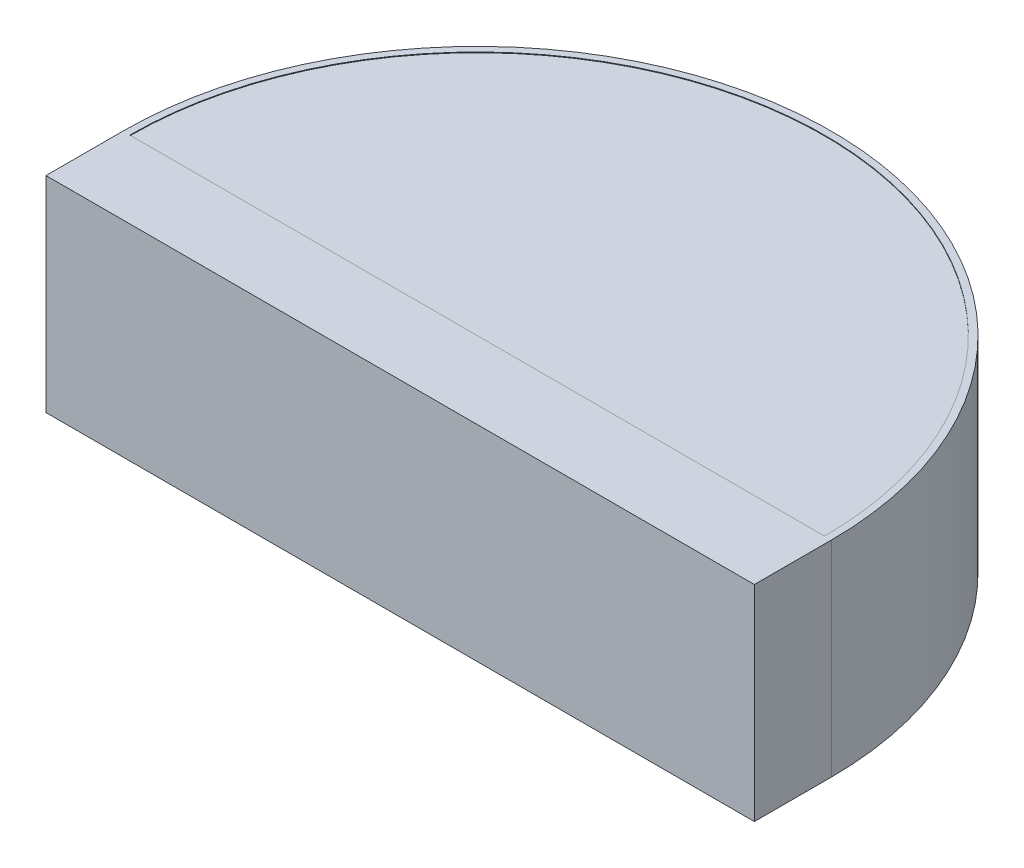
ISO-10303-21;
HEADER;
FILE_DESCRIPTION(('STEP AP214'),'2;1');
FILE_NAME('part.step','',(''),(''),'','','');
FILE_SCHEMA(('AUTOMOTIVE_DESIGN { 1 0 10303 214 1 1 1 1 }'));
ENDSEC;
DATA;
#1=APPLICATION_CONTEXT('core data for automotive mechanical design processes');
#2=APPLICATION_PROTOCOL_DEFINITION('international standard','automotive_design',2000,#1);
#3=PRODUCT_CONTEXT('',#1,'mechanical');
#4=PRODUCT('Part','Part','',(#3));
#5=PRODUCT_RELATED_PRODUCT_CATEGORY('part','',(#4));
#6=PRODUCT_DEFINITION_FORMATION('','',#4);
#7=PRODUCT_DEFINITION_CONTEXT('part definition',#1,'design');
#8=PRODUCT_DEFINITION('design','',#6,#7);
#9=PRODUCT_DEFINITION_SHAPE('','',#8);
#10=(LENGTH_UNIT() NAMED_UNIT(*) SI_UNIT(.MILLI.,.METRE.));
#11=(NAMED_UNIT(*) PLANE_ANGLE_UNIT() SI_UNIT($,.RADIAN.));
#12=(NAMED_UNIT(*) SI_UNIT($,.STERADIAN.) SOLID_ANGLE_UNIT());
#13=UNCERTAINTY_MEASURE_WITH_UNIT(LENGTH_MEASURE(1.E-05),#10,'distance_accuracy_value','');
#14=(GEOMETRIC_REPRESENTATION_CONTEXT(3) GLOBAL_UNCERTAINTY_ASSIGNED_CONTEXT((#13)) GLOBAL_UNIT_ASSIGNED_CONTEXT((#10,
#11,#12)) REPRESENTATION_CONTEXT('',''));
#15=CARTESIAN_POINT('',(0.,0.,0.));
#16=DIRECTION('',(0.,0.,1.));
#17=DIRECTION('',(1.,0.,0.));
#18=AXIS2_PLACEMENT_3D('',#15,#16,#17);
#19=CARTESIAN_POINT('',(-103.5,60.,0.));
#20=DIRECTION('',(1.,0.,0.));
#21=DIRECTION('',(0.,0.,-1.));
#22=AXIS2_PLACEMENT_3D('',#19,#20,#21);
#23=PLANE('',#22);
#24=DIRECTION('',(0.,0.,1.));
#25=VECTOR('',#24,1.);
#26=CARTESIAN_POINT('',(-103.5,0.,0.));
#27=LINE('',#26,#25);
#28=CARTESIAN_POINT('',(-103.5,0.,-22.5));
#29=VERTEX_POINT('',#28);
#30=CARTESIAN_POINT('',(-103.5,0.,0.));
#31=VERTEX_POINT('',#30);
#32=EDGE_CURVE('E150',#29,#31,#27,.T.);
#33=ORIENTED_EDGE('',*,*,#32,.T.);
#34=DIRECTION('',(0.,-1.,0.));
#35=VECTOR('',#34,1.);
#36=CARTESIAN_POINT('',(-103.5,60.,0.));
#37=LINE('',#36,#35);
#38=CARTESIAN_POINT('',(-103.5,60.,0.));
#39=VERTEX_POINT('',#38);
#40=EDGE_CURVE('E11',#39,#31,#37,.T.);
#41=ORIENTED_EDGE('',*,*,#40,.F.);
#42=DIRECTION('',(0.,0.,1.));
#43=VECTOR('',#42,1.);
#44=CARTESIAN_POINT('',(-103.5,60.,0.));
#45=LINE('',#44,#43);
#46=CARTESIAN_POINT('',(-103.5,60.,-22.5));
#47=VERTEX_POINT('',#46);
#48=EDGE_CURVE('E153',#47,#39,#45,.T.);
#49=ORIENTED_EDGE('',*,*,#48,.F.);
#50=DIRECTION('',(0.,-1.,0.));
#51=VECTOR('',#50,1.);
#52=CARTESIAN_POINT('',(-103.5,60.,-22.5));
#53=LINE('',#52,#51);
#54=EDGE_CURVE('E167',#47,#29,#53,.T.);
#55=ORIENTED_EDGE('',*,*,#54,.T.);
#56=EDGE_LOOP('',(#33,#41,#49,#55));
#57=FACE_BOUND('',#56,.T.);
#58=ADVANCED_FACE('F41',(#57),#23,.F.);
#59=CARTESIAN_POINT('',(103.5,60.,0.));
#60=DIRECTION('',(0.,0.,-1.));
#61=DIRECTION('',(-1.,0.,0.));
#62=AXIS2_PLACEMENT_3D('',#59,#60,#61);
#63=PLANE('',#62);
#64=DIRECTION('',(1.,0.,0.));
#65=VECTOR('',#64,1.);
#66=CARTESIAN_POINT('',(103.5,0.,0.));
#67=LINE('',#66,#65);
#68=CARTESIAN_POINT('',(103.5,0.,0.));
#69=VERTEX_POINT('',#68);
#70=EDGE_CURVE('E171',#31,#69,#67,.T.);
#71=ORIENTED_EDGE('',*,*,#70,.T.);
#72=DIRECTION('',(0.,-1.,0.));
#73=VECTOR('',#72,1.);
#74=CARTESIAN_POINT('',(103.5,60.,0.));
#75=LINE('',#74,#73);
#76=CARTESIAN_POINT('',(103.5,60.,0.));
#77=VERTEX_POINT('',#76);
#78=EDGE_CURVE('E49',#77,#69,#75,.T.);
#79=ORIENTED_EDGE('',*,*,#78,.F.);
#80=DIRECTION('',(1.,0.,0.));
#81=VECTOR('',#80,1.);
#82=CARTESIAN_POINT('',(103.5,60.,0.));
#83=LINE('',#82,#81);
#84=EDGE_CURVE('E157',#39,#77,#83,.T.);
#85=ORIENTED_EDGE('',*,*,#84,.F.);
#86=ORIENTED_EDGE('',*,*,#40,.T.);
#87=EDGE_LOOP('',(#71,#79,#85,#86));
#88=FACE_BOUND('',#87,.T.);
#89=ADVANCED_FACE('F207',(#88),#63,.F.);
#90=CARTESIAN_POINT('',(103.5,60.,-22.5));
#91=DIRECTION('',(-1.,0.,0.));
#92=DIRECTION('',(0.,0.,1.));
#93=AXIS2_PLACEMENT_3D('',#90,#91,#92);
#94=PLANE('',#93);
#95=DIRECTION('',(0.,0.,-1.));
#96=VECTOR('',#95,1.);
#97=CARTESIAN_POINT('',(103.5,0.,-22.5));
#98=LINE('',#97,#96);
#99=CARTESIAN_POINT('',(103.5,0.,-22.5));
#100=VERTEX_POINT('',#99);
#101=EDGE_CURVE('E174',#69,#100,#98,.T.);
#102=ORIENTED_EDGE('',*,*,#101,.T.);
#103=DIRECTION('',(0.,-1.,0.));
#104=VECTOR('',#103,1.);
#105=CARTESIAN_POINT('',(103.5,60.,-22.5));
#106=LINE('',#105,#104);
#107=CARTESIAN_POINT('',(103.5,60.,-22.5));
#108=VERTEX_POINT('',#107);
#109=EDGE_CURVE('E182',#108,#100,#106,.T.);
#110=ORIENTED_EDGE('',*,*,#109,.F.);
#111=DIRECTION('',(0.,0.,-1.));
#112=VECTOR('',#111,1.);
#113=CARTESIAN_POINT('',(103.5,60.,-22.5));
#114=LINE('',#113,#112);
#115=EDGE_CURVE('E161',#77,#108,#114,.T.);
#116=ORIENTED_EDGE('',*,*,#115,.F.);
#117=ORIENTED_EDGE('',*,*,#78,.T.);
#118=EDGE_LOOP('',(#102,#110,#116,#117));
#119=FACE_BOUND('',#118,.T.);
#120=ADVANCED_FACE('F191',(#119),#94,.F.);
#121=CARTESIAN_POINT('',(0.,60.,-22.5));
#122=DIRECTION('',(0.,-1.,0.));
#123=DIRECTION('',(0.,0.,-1.));
#124=AXIS2_PLACEMENT_3D('',#121,#122,#123);
#125=CYLINDRICAL_SURFACE('',#124,103.5);
#126=CARTESIAN_POINT('',(0.,0.,-22.5));
#127=DIRECTION('',(0.,1.,0.));
#128=DIRECTION('',(0.,0.,1.));
#129=AXIS2_PLACEMENT_3D('',#126,#127,#128);
#130=CIRCLE('',#129,103.5);
#131=EDGE_CURVE('E158',#100,#29,#130,.T.);
#132=ORIENTED_EDGE('',*,*,#131,.T.);
#133=ORIENTED_EDGE('',*,*,#54,.F.);
#134=CARTESIAN_POINT('',(0.,60.,-22.5));
#135=DIRECTION('',(0.,1.,0.));
#136=DIRECTION('',(0.,0.,1.));
#137=AXIS2_PLACEMENT_3D('',#134,#135,#136);
#138=CIRCLE('',#137,103.5);
#139=EDGE_CURVE('E164',#108,#47,#138,.T.);
#140=ORIENTED_EDGE('',*,*,#139,.F.);
#141=ORIENTED_EDGE('',*,*,#109,.T.);
#142=EDGE_LOOP('',(#132,#133,#140,#141));
#143=FACE_BOUND('',#142,.T.);
#144=ADVANCED_FACE('F200',(#143),#125,.T.);
#145=CARTESIAN_POINT('',(0.,60.,-22.5));
#146=DIRECTION('',(0.,1.,0.));
#147=DIRECTION('',(0.,0.,1.));
#148=AXIS2_PLACEMENT_3D('',#145,#146,#147);
#149=PLANE('',#148);
#150=CARTESIAN_POINT('',(0.,60.,-22.5));
#151=DIRECTION('',(0.,1.,0.));
#152=DIRECTION('',(0.,0.,1.));
#153=AXIS2_PLACEMENT_3D('',#150,#151,#152);
#154=CIRCLE('',#153,101.5);
#155=CARTESIAN_POINT('',(101.5,60.,-22.5));
#156=VERTEX_POINT('',#155);
#157=CARTESIAN_POINT('',(-101.5,60.,-22.5));
#158=VERTEX_POINT('',#157);
#159=EDGE_CURVE('E64',#156,#158,#154,.T.);
#160=ORIENTED_EDGE('',*,*,#159,.F.);
#161=DIRECTION('',(1.,0.,0.));
#162=VECTOR('',#161,1.);
#163=CARTESIAN_POINT('',(-101.5,60.,-22.5));
#164=LINE('',#163,#162);
#165=EDGE_CURVE('E137',#158,#156,#164,.T.);
#166=ORIENTED_EDGE('',*,*,#165,.F.);
#167=EDGE_LOOP('',(#160,#166));
#168=FACE_BOUND('',#167,.T.);
#169=ORIENTED_EDGE('',*,*,#48,.T.);
#170=ORIENTED_EDGE('',*,*,#84,.T.);
#171=ORIENTED_EDGE('',*,*,#115,.T.);
#172=ORIENTED_EDGE('',*,*,#139,.T.);
#173=EDGE_LOOP('',(#169,#170,#171,#172));
#174=FACE_BOUND('',#173,.T.);
#175=ADVANCED_FACE('F206',(#168,#174),#149,.T.);
#176=CARTESIAN_POINT('',(0.,0.,-22.5));
#177=DIRECTION('',(0.,1.,0.));
#178=DIRECTION('',(0.,0.,1.));
#179=AXIS2_PLACEMENT_3D('',#176,#177,#178);
#180=PLANE('',#179);
#181=DIRECTION('',(-1.,0.,0.));
#182=VECTOR('',#181,1.);
#183=CARTESIAN_POINT('',(-101.5,0.,-22.5));
#184=LINE('',#183,#182);
#185=CARTESIAN_POINT('',(101.5,0.,-22.5));
#186=VERTEX_POINT('',#185);
#187=CARTESIAN_POINT('',(-101.5,0.,-22.5));
#188=VERTEX_POINT('',#187);
#189=EDGE_CURVE('E120',#186,#188,#184,.T.);
#190=ORIENTED_EDGE('',*,*,#189,.F.);
#191=CARTESIAN_POINT('',(0.,0.,-22.5));
#192=DIRECTION('',(0.,-1.,0.));
#193=DIRECTION('',(0.,0.,-1.));
#194=AXIS2_PLACEMENT_3D('',#191,#192,#193);
#195=CIRCLE('',#194,101.5);
#196=EDGE_CURVE('E56',#188,#186,#195,.T.);
#197=ORIENTED_EDGE('',*,*,#196,.F.);
#198=EDGE_LOOP('',(#190,#197));
#199=FACE_BOUND('',#198,.T.);
#200=ORIENTED_EDGE('',*,*,#32,.F.);
#201=ORIENTED_EDGE('',*,*,#131,.F.);
#202=ORIENTED_EDGE('',*,*,#101,.F.);
#203=ORIENTED_EDGE('',*,*,#70,.F.);
#204=EDGE_LOOP('',(#200,#201,#202,#203));
#205=FACE_BOUND('',#204,.T.);
#206=ADVANCED_FACE('F197',(#199,#205),#180,.F.);
#207=CARTESIAN_POINT('',(0.,59.8,-22.5));
#208=DIRECTION('',(0.,1.,0.));
#209=DIRECTION('',(0.,0.,1.));
#210=AXIS2_PLACEMENT_3D('',#207,#208,#209);
#211=CYLINDRICAL_SURFACE('',#210,101.5);
#212=ORIENTED_EDGE('',*,*,#159,.T.);
#213=DIRECTION('',(0.,1.,0.));
#214=VECTOR('',#213,1.);
#215=CARTESIAN_POINT('',(-101.5,59.8,-22.5));
#216=LINE('',#215,#214);
#217=CARTESIAN_POINT('',(-101.5,59.8,-22.5));
#218=VERTEX_POINT('',#217);
#219=EDGE_CURVE('E141',#218,#158,#216,.T.);
#220=ORIENTED_EDGE('',*,*,#219,.F.);
#221=CARTESIAN_POINT('',(0.,59.8,-22.5));
#222=DIRECTION('',(0.,1.,0.));
#223=DIRECTION('',(0.,0.,1.));
#224=AXIS2_PLACEMENT_3D('',#221,#222,#223);
#225=CIRCLE('',#224,101.5);
#226=CARTESIAN_POINT('',(101.5,59.8,-22.5));
#227=VERTEX_POINT('',#226);
#228=EDGE_CURVE('E132',#227,#218,#225,.T.);
#229=ORIENTED_EDGE('',*,*,#228,.F.);
#230=DIRECTION('',(0.,1.,0.));
#231=VECTOR('',#230,1.);
#232=CARTESIAN_POINT('',(101.5,59.8,-22.5));
#233=LINE('',#232,#231);
#234=EDGE_CURVE('E147',#227,#156,#233,.T.);
#235=ORIENTED_EDGE('',*,*,#234,.T.);
#236=EDGE_LOOP('',(#212,#220,#229,#235));
#237=FACE_BOUND('',#236,.T.);
#238=ADVANCED_FACE('F219',(#237),#211,.F.);
#239=CARTESIAN_POINT('',(-101.5,59.8,-22.5));
#240=DIRECTION('',(0.,0.,1.));
#241=DIRECTION('',(1.,0.,0.));
#242=AXIS2_PLACEMENT_3D('',#239,#240,#241);
#243=PLANE('',#242);
#244=ORIENTED_EDGE('',*,*,#165,.T.);
#245=ORIENTED_EDGE('',*,*,#234,.F.);
#246=DIRECTION('',(1.,0.,0.));
#247=VECTOR('',#246,1.);
#248=CARTESIAN_POINT('',(-101.5,59.8,-22.5));
#249=LINE('',#248,#247);
#250=EDGE_CURVE('E136',#218,#227,#249,.T.);
#251=ORIENTED_EDGE('',*,*,#250,.F.);
#252=ORIENTED_EDGE('',*,*,#219,.T.);
#253=EDGE_LOOP('',(#244,#245,#251,#252));
#254=FACE_BOUND('',#253,.T.);
#255=ADVANCED_FACE('F226',(#254),#243,.F.);
#256=CARTESIAN_POINT('',(0.,59.8,-22.5));
#257=DIRECTION('',(0.,1.,0.));
#258=DIRECTION('',(0.,0.,1.));
#259=AXIS2_PLACEMENT_3D('',#256,#257,#258);
#260=PLANE('',#259);
#261=ORIENTED_EDGE('',*,*,#228,.T.);
#262=ORIENTED_EDGE('',*,*,#250,.T.);
#263=EDGE_LOOP('',(#261,#262));
#264=FACE_BOUND('',#263,.T.);
#265=ADVANCED_FACE('F229',(#264),#260,.T.);
#266=CARTESIAN_POINT('',(0.,0.2,-22.5));
#267=DIRECTION('',(0.,-1.,0.));
#268=DIRECTION('',(0.,0.,-1.));
#269=AXIS2_PLACEMENT_3D('',#266,#267,#268);
#270=CYLINDRICAL_SURFACE('',#269,101.5);
#271=ORIENTED_EDGE('',*,*,#196,.T.);
#272=DIRECTION('',(0.,-1.,0.));
#273=VECTOR('',#272,1.);
#274=CARTESIAN_POINT('',(101.5,0.2,-22.5));
#275=LINE('',#274,#273);
#276=CARTESIAN_POINT('',(101.5,0.2,-22.5));
#277=VERTEX_POINT('',#276);
#278=EDGE_CURVE('E104',#277,#186,#275,.T.);
#279=ORIENTED_EDGE('',*,*,#278,.F.);
#280=CARTESIAN_POINT('',(0.,0.2,-22.5));
#281=DIRECTION('',(0.,-1.,0.));
#282=DIRECTION('',(0.,0.,-1.));
#283=AXIS2_PLACEMENT_3D('',#280,#281,#282);
#284=CIRCLE('',#283,101.5);
#285=CARTESIAN_POINT('',(-101.5,0.2,-22.5));
#286=VERTEX_POINT('',#285);
#287=EDGE_CURVE('E107',#286,#277,#284,.T.);
#288=ORIENTED_EDGE('',*,*,#287,.F.);
#289=DIRECTION('',(0.,-1.,0.));
#290=VECTOR('',#289,1.);
#291=CARTESIAN_POINT('',(-101.5,0.2,-22.5));
#292=LINE('',#291,#290);
#293=EDGE_CURVE('E114',#286,#188,#292,.T.);
#294=ORIENTED_EDGE('',*,*,#293,.T.);
#295=EDGE_LOOP('',(#271,#279,#288,#294));
#296=FACE_BOUND('',#295,.T.);
#297=ADVANCED_FACE('F106',(#296),#270,.F.);
#298=CARTESIAN_POINT('',(-101.5,0.2,-22.5));
#299=DIRECTION('',(0.,0.,1.));
#300=DIRECTION('',(1.,0.,0.));
#301=AXIS2_PLACEMENT_3D('',#298,#299,#300);
#302=PLANE('',#301);
#303=ORIENTED_EDGE('',*,*,#189,.T.);
#304=ORIENTED_EDGE('',*,*,#293,.F.);
#305=DIRECTION('',(-1.,0.,0.));
#306=VECTOR('',#305,1.);
#307=CARTESIAN_POINT('',(-101.5,0.2,-22.5));
#308=LINE('',#307,#306);
#309=EDGE_CURVE('E115',#277,#286,#308,.T.);
#310=ORIENTED_EDGE('',*,*,#309,.F.);
#311=ORIENTED_EDGE('',*,*,#278,.T.);
#312=EDGE_LOOP('',(#303,#304,#310,#311));
#313=FACE_BOUND('',#312,.T.);
#314=ADVANCED_FACE('F122',(#313),#302,.F.);
#315=CARTESIAN_POINT('',(0.,0.2,-22.5));
#316=DIRECTION('',(0.,-1.,0.));
#317=DIRECTION('',(0.,0.,-1.));
#318=AXIS2_PLACEMENT_3D('',#315,#316,#317);
#319=PLANE('',#318);
#320=ORIENTED_EDGE('',*,*,#287,.T.);
#321=ORIENTED_EDGE('',*,*,#309,.T.);
#322=EDGE_LOOP('',(#320,#321));
#323=FACE_BOUND('',#322,.T.);
#324=ADVANCED_FACE('F118',(#323),#319,.T.);
#325=CLOSED_SHELL('',(#58,#89,#120,#144,#175,#206,#238,#255,#265,#297,#314,#324));
#326=MANIFOLD_SOLID_BREP('B2',#325);
#327=ADVANCED_BREP_SHAPE_REPRESENTATION('',(#18,#326),#14);
#328=SHAPE_DEFINITION_REPRESENTATION(#9,#327);
ENDSEC;
END-ISO-10303-21;
